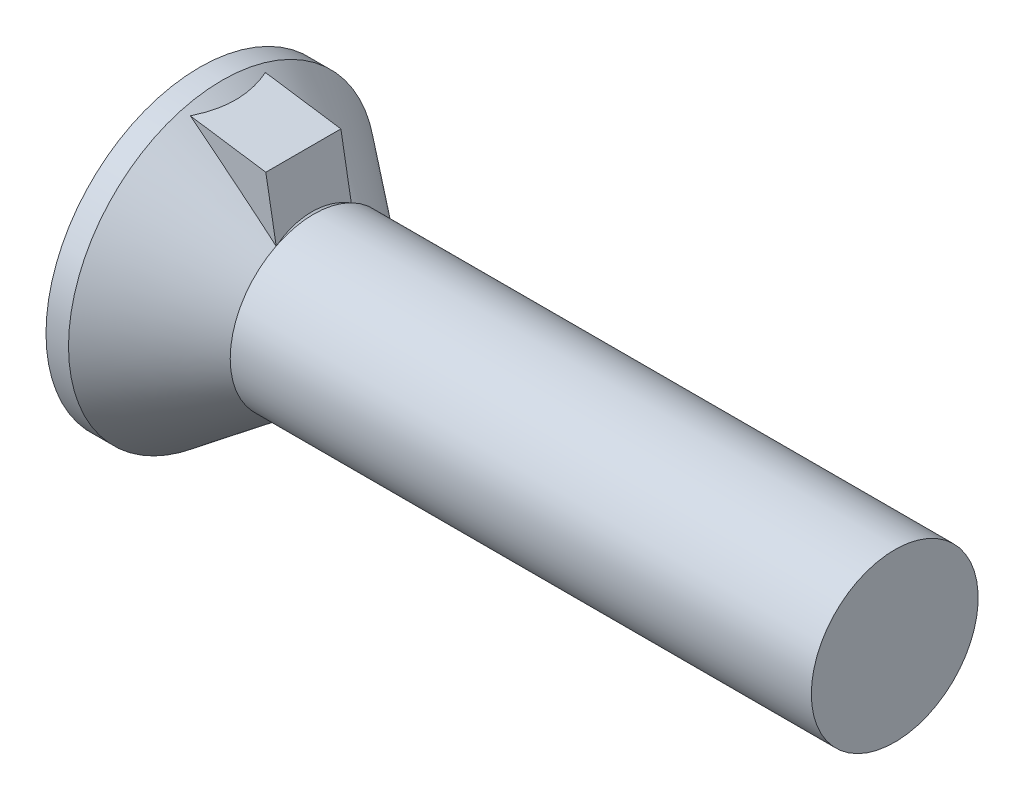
ISO-10303-21;
HEADER;
FILE_DESCRIPTION(('STEP AP214'),'2;1');
FILE_NAME('part.step','',(''),(''),'','','');
FILE_SCHEMA(('AUTOMOTIVE_DESIGN { 1 0 10303 214 1 1 1 1 }'));
ENDSEC;
DATA;
#1=APPLICATION_CONTEXT('core data for automotive mechanical design processes');
#2=APPLICATION_PROTOCOL_DEFINITION('international standard','automotive_design',2000,#1);
#3=PRODUCT_CONTEXT('',#1,'mechanical');
#4=PRODUCT('Part','Part','',(#3));
#5=PRODUCT_RELATED_PRODUCT_CATEGORY('part','',(#4));
#6=PRODUCT_DEFINITION_FORMATION('','',#4);
#7=PRODUCT_DEFINITION_CONTEXT('part definition',#1,'design');
#8=PRODUCT_DEFINITION('design','',#6,#7);
#9=PRODUCT_DEFINITION_SHAPE('','',#8);
#10=(LENGTH_UNIT() NAMED_UNIT(*) SI_UNIT(.MILLI.,.METRE.));
#11=(NAMED_UNIT(*) PLANE_ANGLE_UNIT() SI_UNIT($,.RADIAN.));
#12=(NAMED_UNIT(*) SI_UNIT($,.STERADIAN.) SOLID_ANGLE_UNIT());
#13=UNCERTAINTY_MEASURE_WITH_UNIT(LENGTH_MEASURE(1.E-05),#10,'distance_accuracy_value','');
#14=(GEOMETRIC_REPRESENTATION_CONTEXT(3) GLOBAL_UNCERTAINTY_ASSIGNED_CONTEXT((#13)) GLOBAL_UNIT_ASSIGNED_CONTEXT((#10,
#11,#12)) REPRESENTATION_CONTEXT('',''));
#15=CARTESIAN_POINT('',(0.,0.,0.));
#16=DIRECTION('',(0.,0.,1.));
#17=DIRECTION('',(1.,0.,0.));
#18=AXIS2_PLACEMENT_3D('',#15,#16,#17);
#19=CARTESIAN_POINT('',(4.1,0.,0.));
#20=DIRECTION('',(-1.,0.,0.));
#21=DIRECTION('',(0.,0.,1.));
#22=AXIS2_PLACEMENT_3D('',#19,#20,#21);
#23=CONICAL_SURFACE('',#22,3.,0.654498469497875);
#24=CARTESIAN_POINT('',(4.1,0.,0.));
#25=DIRECTION('',(-1.,0.,0.));
#26=DIRECTION('',(0.,0.,1.));
#27=AXIS2_PLACEMENT_3D('',#24,#25,#26);
#28=CIRCLE('',#27,3.);
#29=CARTESIAN_POINT('',(4.1,2.7,1.3076696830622));
#30=VERTEX_POINT('',#29);
#31=CARTESIAN_POINT('',(4.1,2.7,-1.3076696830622));
#32=VERTEX_POINT('',#31);
#33=EDGE_CURVE('E159',#30,#32,#28,.T.);
#34=ORIENTED_EDGE('',*,*,#33,.T.);
#35=CARTESIAN_POINT('',(4.51205464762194,0.363121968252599,0.));
#36=DIRECTION('',(0.984807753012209,0.173648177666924,0.));
#37=DIRECTION('',(-0.173648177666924,0.984807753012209,0.));
#38=AXIS2_PLACEMENT_3D('',#35,#36,#37);
#39=ELLIPSE('',#38,2.72522158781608,2.65914060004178);
#40=EDGE_CURVE('E161',#32,#30,#39,.T.);
#41=ORIENTED_EDGE('',*,*,#40,.T.);
#42=EDGE_LOOP('',(#34,#41));
#43=FACE_BOUND('',#42,.T.);
#44=ADVANCED_FACE('F37',(#43),#23,.T.);
#45=CARTESIAN_POINT('',(0.,0.,0.));
#46=DIRECTION('',(1.,0.,0.));
#47=DIRECTION('',(0.,0.,-1.));
#48=AXIS2_PLACEMENT_3D('',#45,#46,#47);
#49=PLANE('',#48);
#50=CARTESIAN_POINT('',(0.,0.,0.));
#51=DIRECTION('',(-1.,0.,0.));
#52=DIRECTION('',(0.,0.,1.));
#53=AXIS2_PLACEMENT_3D('',#50,#51,#52);
#54=CIRCLE('',#53,5.525);
#55=CARTESIAN_POINT('',(0.,0.,5.525));
#56=VERTEX_POINT('',#55);
#57=EDGE_CURVE('E172',#56,#56,#54,.T.);
#58=ORIENTED_EDGE('',*,*,#57,.T.);
#59=EDGE_LOOP('',(#58));
#60=FACE_BOUND('',#59,.T.);
#61=ADVANCED_FACE('F39',(#60),#49,.F.);
#62=CARTESIAN_POINT('',(-1.71435535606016,0.,0.));
#63=DIRECTION('',(-1.,0.,0.));
#64=DIRECTION('',(0.,0.,1.));
#65=AXIS2_PLACEMENT_3D('',#62,#63,#64);
#66=CYLINDRICAL_SURFACE('',#65,5.525);
#67=CARTESIAN_POINT('',(0.809355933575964,0.,0.));
#68=DIRECTION('',(-1.,0.,0.));
#69=DIRECTION('',(0.,0.,1.));
#70=AXIS2_PLACEMENT_3D('',#67,#68,#69);
#71=CIRCLE('',#70,5.525);
#72=CARTESIAN_POINT('',(0.809355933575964,0.,5.525));
#73=VERTEX_POINT('',#72);
#74=EDGE_CURVE('E162',#73,#73,#71,.T.);
#75=ORIENTED_EDGE('',*,*,#74,.T.);
#76=EDGE_LOOP('',(#75));
#77=FACE_BOUND('',#76,.T.);
#78=ORIENTED_EDGE('',*,*,#57,.F.);
#79=EDGE_LOOP('',(#78));
#80=FACE_BOUND('',#79,.T.);
#81=ADVANCED_FACE('F149',(#77,#80),#66,.T.);
#82=CARTESIAN_POINT('',(4.1,2.67908566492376,-1.35));
#83=VERTEX_POINT('',#82);
#84=CARTESIAN_POINT('',(4.1,2.67908566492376,1.35));
#85=VERTEX_POINT('',#84);
#86=EDGE_CURVE('E163',#83,#85,#28,.T.);
#87=ORIENTED_EDGE('',*,*,#86,.T.);
#88=CARTESIAN_POINT('',(-6.10405466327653,-10.745374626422,1.35));
#89=CARTESIAN_POINT('',(-5.6846367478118,-10.4210016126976,1.35));
#90=CARTESIAN_POINT('',(-5.2653178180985,-10.0965004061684,1.35));
#91=CARTESIAN_POINT('',(-4.42695643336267,-9.44709996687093,1.35));
#92=CARTESIAN_POINT('',(-4.00791399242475,-9.12220071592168,1.35));
#93=CARTESIAN_POINT('',(-3.1694143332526,-8.47126482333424,1.35));
#94=CARTESIAN_POINT('',(-2.74995787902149,-8.14522719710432,1.35));
#95=CARTESIAN_POINT('',(-1.91163137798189,-7.49243806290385,1.35));
#96=CARTESIAN_POINT('',(-1.49276130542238,-7.16568658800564,1.35));
#97=CARTESIAN_POINT('',(-0.608121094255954,-6.47378997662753,1.35));
#98=CARTESIAN_POINT('',(-0.142451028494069,-6.10851668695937,1.35));
#99=CARTESIAN_POINT('',(0.554778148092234,-5.55891745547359,1.35));
#100=CARTESIAN_POINT('',(0.786992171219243,-5.37542266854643,1.35));
#101=CARTESIAN_POINT('',(1.25082024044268,-5.00768101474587,1.35));
#102=CARTESIAN_POINT('',(1.48243429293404,-4.82343415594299,1.35));
#103=CARTESIAN_POINT('',(1.94449273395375,-4.4541762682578,1.35));
#104=CARTESIAN_POINT('',(2.17493834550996,-4.26916677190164,1.35));
#105=CARTESIAN_POINT('',(2.63463706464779,-3.89765073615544,1.35));
#106=CARTESIAN_POINT('',(2.8638901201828,-3.71114413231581,1.35));
#107=CARTESIAN_POINT('',(3.32051265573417,-3.33594787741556,1.35));
#108=CARTESIAN_POINT('',(3.54788260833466,-3.14725880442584,1.35));
#109=CARTESIAN_POINT('',(3.88662860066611,-2.86150208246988,1.35));
#110=CARTESIAN_POINT('',(3.99915513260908,-2.76579945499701,1.35));
#111=CARTESIAN_POINT('',(4.22316705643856,-2.5731847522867,1.35));
#112=CARTESIAN_POINT('',(4.33465247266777,-2.47627270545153,1.35));
#113=CARTESIAN_POINT('',(4.51233698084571,-2.31949711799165,1.35));
#114=CARTESIAN_POINT('',(4.57899410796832,-2.26015294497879,1.35));
#115=CARTESIAN_POINT('',(4.71165328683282,-2.14073052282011,1.35));
#116=CARTESIAN_POINT('',(4.7776553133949,-2.08065224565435,1.35));
#117=CARTESIAN_POINT('',(4.90893845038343,-1.95949160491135,1.35));
#118=CARTESIAN_POINT('',(4.97421816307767,-1.89840772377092,1.35));
#119=CARTESIAN_POINT('',(5.10369494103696,-1.77510877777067,1.35));
#120=CARTESIAN_POINT('',(5.16789208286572,-1.71289379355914,1.35));
#121=CARTESIAN_POINT('',(5.29431031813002,-1.58755833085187,1.35));
#122=CARTESIAN_POINT('',(5.3565436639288,-1.52445025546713,1.35));
#123=CARTESIAN_POINT('',(5.4790898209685,-1.39639890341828,1.35));
#124=CARTESIAN_POINT('',(5.53940287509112,-1.3314558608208,1.35));
#125=CARTESIAN_POINT('',(5.65718673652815,-1.19929624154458,1.35));
#126=CARTESIAN_POINT('',(5.71466378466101,-1.13208526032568,1.35));
#127=CARTESIAN_POINT('',(5.82563696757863,-0.994475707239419,1.35));
#128=CARTESIAN_POINT('',(5.87913628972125,-0.924079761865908,1.35));
#129=CARTESIAN_POINT('',(5.95740773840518,-0.811485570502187,1.35));
#130=CARTESIAN_POINT('',(5.98431528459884,-0.770777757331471,1.35));
#131=CARTESIAN_POINT('',(6.0357030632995,-0.68782224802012,1.35));
#132=CARTESIAN_POINT('',(6.06018241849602,-0.645574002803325,1.35));
#133=CARTESIAN_POINT('',(6.10583729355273,-0.559608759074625,1.35));
#134=CARTESIAN_POINT('',(6.12703062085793,-0.515901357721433,1.35));
#135=CARTESIAN_POINT('',(6.16532687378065,-0.426749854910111,1.35));
#136=CARTESIAN_POINT('',(6.18243295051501,-0.381307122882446,1.35));
#137=CARTESIAN_POINT('',(6.21555270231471,-0.275752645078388,1.35));
#138=CARTESIAN_POINT('',(6.22991763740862,-0.215098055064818,1.35));
#139=CARTESIAN_POINT('',(6.24801206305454,-0.0921817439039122,1.35));
#140=CARTESIAN_POINT('',(6.25174696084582,-0.0299208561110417,1.35));
#141=CARTESIAN_POINT('',(6.24789758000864,0.0942699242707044,1.35));
#142=CARTESIAN_POINT('',(6.24030635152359,0.156199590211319,1.35));
#143=CARTESIAN_POINT('',(6.2151340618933,0.277973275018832,1.35));
#144=CARTESIAN_POINT('',(6.19754132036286,0.337814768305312,1.35));
#145=CARTESIAN_POINT('',(6.15823100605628,0.44495195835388,1.35));
#146=CARTESIAN_POINT('',(6.13767121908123,0.492689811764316,1.35));
#147=CARTESIAN_POINT('',(6.09245087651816,0.586204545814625,1.35));
#148=CARTESIAN_POINT('',(6.06778691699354,0.631979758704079,1.35));
#149=CARTESIAN_POINT('',(6.01525960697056,0.721910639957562,1.35));
#150=CARTESIAN_POINT('',(5.98738217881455,0.766057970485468,1.35));
#151=CARTESIAN_POINT('',(5.92928894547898,0.852744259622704,1.35));
#152=CARTESIAN_POINT('',(5.89907415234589,0.89528390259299,1.35));
#153=CARTESIAN_POINT('',(5.83537754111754,0.980994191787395,1.35));
#154=CARTESIAN_POINT('',(5.8018088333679,1.02409985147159,1.35));
#155=CARTESIAN_POINT('',(5.73314680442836,1.10908343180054,1.35));
#156=CARTESIAN_POINT('',(5.69805322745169,1.15096114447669,1.35));
#157=CARTESIAN_POINT('',(5.59095300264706,1.27512038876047,1.35));
#158=CARTESIAN_POINT('',(5.51717230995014,1.35586881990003,1.35));
#159=CARTESIAN_POINT('',(5.36641672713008,1.5146678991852,1.35));
#160=CARTESIAN_POINT('',(5.28943429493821,1.59271127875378,1.35));
#161=CARTESIAN_POINT('',(5.13338306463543,1.74669481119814,1.35));
#162=CARTESIAN_POINT('',(5.05431401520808,1.82263470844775,1.35));
#163=CARTESIAN_POINT('',(4.89435691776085,1.97325845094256,1.35));
#164=CARTESIAN_POINT('',(4.81346254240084,2.04793554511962,1.35));
#165=CARTESIAN_POINT('',(4.65056459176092,2.19608181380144,1.35));
#166=CARTESIAN_POINT('',(4.56856091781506,2.26955087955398,1.35));
#167=CARTESIAN_POINT('',(4.40386173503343,2.41541285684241,1.35));
#168=CARTESIAN_POINT('',(4.3211677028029,2.48780743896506,1.35));
#169=CARTESIAN_POINT('',(4.15513110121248,2.63184201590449,1.35));
#170=CARTESIAN_POINT('',(4.07178855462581,2.70348203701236,1.35));
#171=CARTESIAN_POINT('',(3.82327322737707,2.91555200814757,1.35));
#172=CARTESIAN_POINT('',(3.65735841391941,3.05511198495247,1.35));
#173=CARTESIAN_POINT('',(3.32420307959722,3.33264217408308,1.35));
#174=CARTESIAN_POINT('',(3.15696252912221,3.47061235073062,1.35));
#175=CARTESIAN_POINT('',(2.82153505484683,3.74542189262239,1.35));
#176=CARTESIAN_POINT('',(2.65334806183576,3.88226117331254,1.35));
#177=CARTESIAN_POINT('',(2.31629005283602,4.15509519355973,1.35));
#178=CARTESIAN_POINT('',(2.14741903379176,4.29108992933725,1.35));
#179=CARTESIAN_POINT('',(1.63976846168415,4.69834525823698,1.35));
#180=CARTESIAN_POINT('',(1.3002254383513,4.968653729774,1.35));
#181=CARTESIAN_POINT('',(0.619928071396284,5.50770902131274,1.35));
#182=CARTESIAN_POINT('',(0.279173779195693,5.77645590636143,1.35));
#183=CARTESIAN_POINT('',(-0.401790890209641,6.31185148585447,1.35));
#184=CARTESIAN_POINT('',(-0.741998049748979,6.57850427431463,1.35));
#185=CARTESIAN_POINT('',(-1.42297427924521,7.11109844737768,1.35));
#186=CARTESIAN_POINT('',(-1.76374335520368,7.37703982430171,1.35));
#187=CARTESIAN_POINT('',(-2.78647969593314,8.17397155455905,1.35));
#188=CARTESIAN_POINT('',(-3.46904131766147,8.70419906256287,1.35));
#189=CARTESIAN_POINT('',(-4.31451706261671,9.35984621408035,1.35));
#190=CARTESIAN_POINT('',(-4.47701291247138,9.48580617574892,1.35));
#191=CARTESIAN_POINT('',(-4.80205765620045,9.73767050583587,1.35));
#192=CARTESIAN_POINT('',(-4.96460655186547,9.86357487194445,1.35));
#193=CARTESIAN_POINT('',(-5.28995375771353,10.1154918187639,1.35));
#194=CARTESIAN_POINT('',(-5.45275212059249,10.2415043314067,1.35));
#195=CARTESIAN_POINT('',(-5.77837970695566,10.4934765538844,1.35));
#196=CARTESIAN_POINT('',(-5.94120892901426,10.6194362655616,1.35));
#197=CARTESIAN_POINT('',(-6.10405466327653,10.745374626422,1.35));
#198=B_SPLINE_CURVE_WITH_KNOTS('',3,(#88,#89,#90,#91,#92,#93,#94,#95,#96,#97,#98,#99,#100,#101,
#102,#103,#104,#105,#106,#107,#108,#109,#110,#111,#112,#113,#114,#115,#116,#117,#118,#119,#120,
#121,#122,#123,#124,#125,#126,#127,#128,#129,#130,#131,#132,#133,#134,#135,#136,#137,#138,#139,
#140,#141,#142,#143,#144,#145,#146,#147,#148,#149,#150,#151,#152,#153,#154,#155,#156,#157,#158,
#159,#160,#161,#162,#163,#164,#165,#166,#167,#168,#169,#170,#171,#172,#173,#174,#175,#176,#177,
#178,#179,#180,#181,#182,#183,#184,#185,#186,#187,#188,#189,#190,#191,#192,#193,#194,#195,#196,
#197),.UNSPECIFIED.,.F.,.F.,(4,2,2,2,2,2,2,2,2,2,2,2,2,2,2,2,2,2,2,2,2,2,2,2,2,2,2,2,2,2,2,2,2,
2,2,2,2,2,2,2,2,2,2,2,2,2,2,2,2,2,2,2,2,2,4),(0.,1.59064881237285,3.18137321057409,
4.7751725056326,6.36889946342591,8.14441108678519,9.03229689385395,9.92017319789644,
10.8067368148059,11.6933388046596,12.579711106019,13.0228656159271,13.4660097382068,
13.7337445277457,14.001489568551,14.2696845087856,14.5378604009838,14.8037280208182,
15.0695618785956,15.3347819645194,15.5997871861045,15.7461137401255,15.892492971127,
16.0380489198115,16.1834922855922,16.3696836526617,16.555780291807,16.7419911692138,
16.9284199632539,17.0841213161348,17.2399524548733,17.3964942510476,17.5529686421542,
17.7168285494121,17.8807160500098,18.2087145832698,18.5375351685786,18.8663955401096,
19.1966606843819,19.5269553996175,19.8566671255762,20.1863673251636,20.8367672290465,
21.4871817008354,22.1376443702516,22.7881099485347,24.0901014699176,25.3920383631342,
26.6888027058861,27.9855809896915,30.5785076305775,31.1953036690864,31.8121232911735,
32.4297333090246,33.0473196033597),.UNSPECIFIED.);
#199=CARTESIAN_POINT('',(1.01474948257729,5.194847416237,1.35));
#200=VERTEX_POINT('',#199);
#201=EDGE_CURVE('E57',#85,#200,#198,.T.);
#202=ORIENTED_EDGE('',*,*,#201,.T.);
#203=CARTESIAN_POINT('',(1.01466902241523,5.1948592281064,1.3502));
#204=CARTESIAN_POINT('',(1.05143892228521,5.18946126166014,1.25884669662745));
#205=CARTESIAN_POINT('',(1.08530074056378,5.18449021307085,1.16622613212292));
#206=CARTESIAN_POINT('',(1.14629726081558,5.17553568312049,0.978593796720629));
#207=CARTESIAN_POINT('',(1.17342100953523,5.17155380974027,0.883578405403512));
#208=CARTESIAN_POINT('',(1.21981103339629,5.16474357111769,0.691986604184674));
#209=CARTESIAN_POINT('',(1.23910877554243,5.16191058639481,0.595418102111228));
#210=CARTESIAN_POINT('',(1.26918716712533,5.15749495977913,0.400982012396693));
#211=CARTESIAN_POINT('',(1.27997306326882,5.15591154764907,0.303115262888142));
#212=CARTESIAN_POINT('',(1.29259391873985,5.15405875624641,0.105924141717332));
#213=CARTESIAN_POINT('',(1.29434971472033,5.15380099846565,0.00659450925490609));
#214=CARTESIAN_POINT('',(1.28860699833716,5.15464405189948,-0.191814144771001));
#215=CARTESIAN_POINT('',(1.28110598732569,5.15574522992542,-0.290893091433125));
#216=CARTESIAN_POINT('',(1.25722666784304,5.15925080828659,-0.487847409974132));
#217=CARTESIAN_POINT('',(1.2408561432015,5.16165406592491,-0.585723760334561));
#218=CARTESIAN_POINT('',(1.19996942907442,5.16765639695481,-0.779724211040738));
#219=CARTESIAN_POINT('',(1.17545191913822,5.17125566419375,-0.875848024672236));
#220=CARTESIAN_POINT('',(1.12829350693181,5.17817870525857,-1.03521191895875));
#221=CARTESIAN_POINT('',(1.10760020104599,5.18121656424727,-1.099053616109));
#222=CARTESIAN_POINT('',(1.06326961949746,5.18772446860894,-1.22551462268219));
#223=CARTESIAN_POINT('',(1.03963950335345,5.1911934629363,-1.28813649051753));
#224=CARTESIAN_POINT('',(1.01466902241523,5.1948592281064,-1.3502));
#225=B_SPLINE_CURVE_WITH_KNOTS('',3,(#203,#204,#205,#206,#207,#208,#209,#210,#211,#212,#213,
#214,#215,#216,#217,#218,#219,#220,#221,#222,#223,#224),.UNSPECIFIED.,.F.,.F.,(4,2,2,2,2,2,2,2,
2,2,4),(0.,0.295918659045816,0.592315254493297,0.887507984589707,1.18251861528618,
1.48011113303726,1.77778399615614,2.07519604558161,2.37265632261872,2.57412532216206,
2.77511246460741),.UNSPECIFIED.);
#226=CARTESIAN_POINT('',(1.01474948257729,5.194847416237,-1.35));
#227=VERTEX_POINT('',#226);
#228=EDGE_CURVE('E11',#200,#227,#225,.T.);
#229=ORIENTED_EDGE('',*,*,#228,.T.);
#230=CARTESIAN_POINT('',(-6.10405466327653,-10.745374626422,-1.35));
#231=CARTESIAN_POINT('',(-5.6846367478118,-10.4210016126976,-1.35));
#232=CARTESIAN_POINT('',(-5.2653178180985,-10.0965004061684,-1.35));
#233=CARTESIAN_POINT('',(-4.42695643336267,-9.44709996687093,-1.35));
#234=CARTESIAN_POINT('',(-4.00791399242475,-9.12220071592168,-1.35));
#235=CARTESIAN_POINT('',(-3.1694143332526,-8.47126482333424,-1.35));
#236=CARTESIAN_POINT('',(-2.74995787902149,-8.14522719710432,-1.35));
#237=CARTESIAN_POINT('',(-1.91163137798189,-7.49243806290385,-1.35));
#238=CARTESIAN_POINT('',(-1.49276130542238,-7.16568658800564,-1.35));
#239=CARTESIAN_POINT('',(-0.608121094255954,-6.47378997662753,-1.35));
#240=CARTESIAN_POINT('',(-0.142451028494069,-6.10851668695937,-1.35));
#241=CARTESIAN_POINT('',(0.554778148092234,-5.55891745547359,-1.35));
#242=CARTESIAN_POINT('',(0.786992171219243,-5.37542266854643,-1.35));
#243=CARTESIAN_POINT('',(1.25082024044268,-5.00768101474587,-1.35));
#244=CARTESIAN_POINT('',(1.48243429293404,-4.82343415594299,-1.35));
#245=CARTESIAN_POINT('',(1.94449273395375,-4.4541762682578,-1.35));
#246=CARTESIAN_POINT('',(2.17493834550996,-4.26916677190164,-1.35));
#247=CARTESIAN_POINT('',(2.63463706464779,-3.89765073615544,-1.35));
#248=CARTESIAN_POINT('',(2.8638901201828,-3.71114413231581,-1.35));
#249=CARTESIAN_POINT('',(3.32051265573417,-3.33594787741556,-1.35));
#250=CARTESIAN_POINT('',(3.54788260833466,-3.14725880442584,-1.35));
#251=CARTESIAN_POINT('',(3.88662860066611,-2.86150208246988,-1.35));
#252=CARTESIAN_POINT('',(3.99915513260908,-2.76579945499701,-1.35));
#253=CARTESIAN_POINT('',(4.22316705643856,-2.5731847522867,-1.35));
#254=CARTESIAN_POINT('',(4.33465247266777,-2.47627270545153,-1.35));
#255=CARTESIAN_POINT('',(4.51233698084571,-2.31949711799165,-1.35));
#256=CARTESIAN_POINT('',(4.57899410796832,-2.26015294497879,-1.35));
#257=CARTESIAN_POINT('',(4.71165328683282,-2.14073052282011,-1.35));
#258=CARTESIAN_POINT('',(4.7776553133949,-2.08065224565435,-1.35));
#259=CARTESIAN_POINT('',(4.90893845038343,-1.95949160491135,-1.35));
#260=CARTESIAN_POINT('',(4.97421816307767,-1.89840772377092,-1.35));
#261=CARTESIAN_POINT('',(5.10369494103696,-1.77510877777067,-1.35));
#262=CARTESIAN_POINT('',(5.16789208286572,-1.71289379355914,-1.35));
#263=CARTESIAN_POINT('',(5.29431031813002,-1.58755833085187,-1.35));
#264=CARTESIAN_POINT('',(5.3565436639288,-1.52445025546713,-1.35));
#265=CARTESIAN_POINT('',(5.4790898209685,-1.39639890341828,-1.35));
#266=CARTESIAN_POINT('',(5.53940287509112,-1.3314558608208,-1.35));
#267=CARTESIAN_POINT('',(5.65718673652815,-1.19929624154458,-1.35));
#268=CARTESIAN_POINT('',(5.71466378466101,-1.13208526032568,-1.35));
#269=CARTESIAN_POINT('',(5.82563696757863,-0.994475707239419,-1.35));
#270=CARTESIAN_POINT('',(5.87913628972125,-0.924079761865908,-1.35));
#271=CARTESIAN_POINT('',(5.95740773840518,-0.811485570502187,-1.35));
#272=CARTESIAN_POINT('',(5.98431528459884,-0.770777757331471,-1.35));
#273=CARTESIAN_POINT('',(6.0357030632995,-0.68782224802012,-1.35));
#274=CARTESIAN_POINT('',(6.06018241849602,-0.645574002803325,-1.35));
#275=CARTESIAN_POINT('',(6.10583729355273,-0.559608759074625,-1.35));
#276=CARTESIAN_POINT('',(6.12703062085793,-0.515901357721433,-1.35));
#277=CARTESIAN_POINT('',(6.16532687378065,-0.426749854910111,-1.35));
#278=CARTESIAN_POINT('',(6.18243295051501,-0.381307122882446,-1.35));
#279=CARTESIAN_POINT('',(6.21555270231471,-0.275752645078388,-1.35));
#280=CARTESIAN_POINT('',(6.22991763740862,-0.215098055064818,-1.35));
#281=CARTESIAN_POINT('',(6.24801206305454,-0.0921817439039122,-1.35));
#282=CARTESIAN_POINT('',(6.25174696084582,-0.0299208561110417,-1.35));
#283=CARTESIAN_POINT('',(6.24789758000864,0.0942699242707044,-1.35));
#284=CARTESIAN_POINT('',(6.24030635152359,0.156199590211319,-1.35));
#285=CARTESIAN_POINT('',(6.2151340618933,0.277973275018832,-1.35));
#286=CARTESIAN_POINT('',(6.19754132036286,0.337814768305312,-1.35));
#287=CARTESIAN_POINT('',(6.15823100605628,0.44495195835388,-1.35));
#288=CARTESIAN_POINT('',(6.13767121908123,0.492689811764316,-1.35));
#289=CARTESIAN_POINT('',(6.09245087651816,0.586204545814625,-1.35));
#290=CARTESIAN_POINT('',(6.06778691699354,0.631979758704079,-1.35));
#291=CARTESIAN_POINT('',(6.01525960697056,0.721910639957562,-1.35));
#292=CARTESIAN_POINT('',(5.98738217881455,0.766057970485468,-1.35));
#293=CARTESIAN_POINT('',(5.92928894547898,0.852744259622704,-1.35));
#294=CARTESIAN_POINT('',(5.89907415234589,0.89528390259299,-1.35));
#295=CARTESIAN_POINT('',(5.83537754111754,0.980994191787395,-1.35));
#296=CARTESIAN_POINT('',(5.8018088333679,1.02409985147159,-1.35));
#297=CARTESIAN_POINT('',(5.73314680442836,1.10908343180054,-1.35));
#298=CARTESIAN_POINT('',(5.69805322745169,1.15096114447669,-1.35));
#299=CARTESIAN_POINT('',(5.59095300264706,1.27512038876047,-1.35));
#300=CARTESIAN_POINT('',(5.51717230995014,1.35586881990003,-1.35));
#301=CARTESIAN_POINT('',(5.36641672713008,1.5146678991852,-1.35));
#302=CARTESIAN_POINT('',(5.28943429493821,1.59271127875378,-1.35));
#303=CARTESIAN_POINT('',(5.13338306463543,1.74669481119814,-1.35));
#304=CARTESIAN_POINT('',(5.05431401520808,1.82263470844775,-1.35));
#305=CARTESIAN_POINT('',(4.89435691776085,1.97325845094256,-1.35));
#306=CARTESIAN_POINT('',(4.81346254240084,2.04793554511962,-1.35));
#307=CARTESIAN_POINT('',(4.65056459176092,2.19608181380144,-1.35));
#308=CARTESIAN_POINT('',(4.56856091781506,2.26955087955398,-1.35));
#309=CARTESIAN_POINT('',(4.40386173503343,2.41541285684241,-1.35));
#310=CARTESIAN_POINT('',(4.3211677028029,2.48780743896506,-1.35));
#311=CARTESIAN_POINT('',(4.15513110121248,2.63184201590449,-1.35));
#312=CARTESIAN_POINT('',(4.07178855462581,2.70348203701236,-1.35));
#313=CARTESIAN_POINT('',(3.82327322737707,2.91555200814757,-1.35));
#314=CARTESIAN_POINT('',(3.65735841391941,3.05511198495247,-1.35));
#315=CARTESIAN_POINT('',(3.32420307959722,3.33264217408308,-1.35));
#316=CARTESIAN_POINT('',(3.15696252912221,3.47061235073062,-1.35));
#317=CARTESIAN_POINT('',(2.82153505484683,3.74542189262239,-1.35));
#318=CARTESIAN_POINT('',(2.65334806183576,3.88226117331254,-1.35));
#319=CARTESIAN_POINT('',(2.31629005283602,4.15509519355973,-1.35));
#320=CARTESIAN_POINT('',(2.14741903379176,4.29108992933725,-1.35));
#321=CARTESIAN_POINT('',(1.63976846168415,4.69834525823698,-1.35));
#322=CARTESIAN_POINT('',(1.3002254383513,4.968653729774,-1.35));
#323=CARTESIAN_POINT('',(0.619928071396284,5.50770902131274,-1.35));
#324=CARTESIAN_POINT('',(0.279173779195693,5.77645590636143,-1.35));
#325=CARTESIAN_POINT('',(-0.401790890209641,6.31185148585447,-1.35));
#326=CARTESIAN_POINT('',(-0.741998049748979,6.57850427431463,-1.35));
#327=CARTESIAN_POINT('',(-1.42297427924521,7.11109844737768,-1.35));
#328=CARTESIAN_POINT('',(-1.76374335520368,7.37703982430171,-1.35));
#329=CARTESIAN_POINT('',(-2.78647969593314,8.17397155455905,-1.35));
#330=CARTESIAN_POINT('',(-3.46904131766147,8.70419906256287,-1.35));
#331=CARTESIAN_POINT('',(-4.31451706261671,9.35984621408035,-1.35));
#332=CARTESIAN_POINT('',(-4.47701291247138,9.48580617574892,-1.35));
#333=CARTESIAN_POINT('',(-4.80205765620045,9.73767050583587,-1.35));
#334=CARTESIAN_POINT('',(-4.96460655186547,9.86357487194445,-1.35));
#335=CARTESIAN_POINT('',(-5.28995375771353,10.1154918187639,-1.35));
#336=CARTESIAN_POINT('',(-5.45275212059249,10.2415043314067,-1.35));
#337=CARTESIAN_POINT('',(-5.77837970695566,10.4934765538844,-1.35));
#338=CARTESIAN_POINT('',(-5.94120892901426,10.6194362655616,-1.35));
#339=CARTESIAN_POINT('',(-6.10405466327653,10.745374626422,-1.35));
#340=B_SPLINE_CURVE_WITH_KNOTS('',3,(#230,#231,#232,#233,#234,#235,#236,#237,#238,#239,#240,
#241,#242,#243,#244,#245,#246,#247,#248,#249,#250,#251,#252,#253,#254,#255,#256,#257,#258,#259,
#260,#261,#262,#263,#264,#265,#266,#267,#268,#269,#270,#271,#272,#273,#274,#275,#276,#277,#278,
#279,#280,#281,#282,#283,#284,#285,#286,#287,#288,#289,#290,#291,#292,#293,#294,#295,#296,#297,
#298,#299,#300,#301,#302,#303,#304,#305,#306,#307,#308,#309,#310,#311,#312,#313,#314,#315,#316,
#317,#318,#319,#320,#321,#322,#323,#324,#325,#326,#327,#328,#329,#330,#331,#332,#333,#334,#335,
#336,#337,#338,#339),.UNSPECIFIED.,.F.,.F.,(4,2,2,2,2,2,2,2,2,2,2,2,2,2,2,2,2,2,2,2,2,2,2,2,2,2,
2,2,2,2,2,2,2,2,2,2,2,2,2,2,2,2,2,2,2,2,2,2,2,2,2,2,2,2,4),(0.,1.59064881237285,
3.18137321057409,4.7751725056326,6.36889946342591,8.14441108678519,9.03229689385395,
9.92017319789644,10.8067368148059,11.6933388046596,12.579711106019,13.0228656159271,
13.4660097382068,13.7337445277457,14.001489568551,14.2696845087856,14.5378604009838,
14.8037280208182,15.0695618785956,15.3347819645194,15.5997871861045,15.7461137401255,
15.892492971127,16.0380489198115,16.1834922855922,16.3696836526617,16.555780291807,
16.7419911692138,16.9284199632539,17.0841213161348,17.2399524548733,17.3964942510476,
17.5529686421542,17.7168285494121,17.8807160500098,18.2087145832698,18.5375351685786,
18.8663955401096,19.1966606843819,19.5269553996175,19.8566671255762,20.1863673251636,
20.8367672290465,21.4871817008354,22.1376443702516,22.7881099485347,24.0901014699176,
25.3920383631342,26.6888027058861,27.9855809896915,30.5785076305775,31.1953036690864,
31.8121232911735,32.4297333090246,33.0473196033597),.UNSPECIFIED.);
#341=EDGE_CURVE('E107',#83,#227,#340,.T.);
#342=ORIENTED_EDGE('',*,*,#341,.F.);
#343=EDGE_LOOP('',(#87,#202,#229,#342));
#344=FACE_BOUND('',#343,.T.);
#345=ORIENTED_EDGE('',*,*,#74,.F.);
#346=EDGE_LOOP('',(#345));
#347=FACE_BOUND('',#346,.T.);
#348=ADVANCED_FACE('F127',(#344,#347),#23,.T.);
#349=CARTESIAN_POINT('',(-1.71435535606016,0.,0.));
#350=DIRECTION('',(-1.,0.,0.));
#351=DIRECTION('',(0.,0.,1.));
#352=AXIS2_PLACEMENT_3D('',#349,#350,#351);
#353=CYLINDRICAL_SURFACE('',#352,3.);
#354=ORIENTED_EDGE('',*,*,#33,.F.);
#355=CARTESIAN_POINT('',(4.57608284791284,0.,0.));
#356=DIRECTION('',(0.984807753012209,0.173648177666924,0.));
#357=DIRECTION('',(-0.173648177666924,0.984807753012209,0.));
#358=AXIS2_PLACEMENT_3D('',#355,#356,#357);
#359=ELLIPSE('',#358,3.04627983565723,3.);
#360=CARTESIAN_POINT('',(4.10368776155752,2.67908566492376,1.35));
#361=VERTEX_POINT('',#360);
#362=EDGE_CURVE('E51',#30,#361,#359,.T.);
#363=ORIENTED_EDGE('',*,*,#362,.T.);
#364=DIRECTION('',(-1.,0.,0.));
#365=VECTOR('',#364,1.);
#366=CARTESIAN_POINT('',(-1.71435535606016,2.67908566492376,1.35));
#367=LINE('',#366,#365);
#368=EDGE_CURVE('E94',#361,#85,#367,.T.);
#369=ORIENTED_EDGE('',*,*,#368,.T.);
#370=ORIENTED_EDGE('',*,*,#86,.F.);
#371=DIRECTION('',(-1.,0.,0.));
#372=VECTOR('',#371,1.);
#373=CARTESIAN_POINT('',(-1.71435535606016,2.67908566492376,-1.35));
#374=LINE('',#373,#372);
#375=CARTESIAN_POINT('',(4.10368776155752,2.67908566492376,-1.35));
#376=VERTEX_POINT('',#375);
#377=EDGE_CURVE('E175',#376,#83,#374,.T.);
#378=ORIENTED_EDGE('',*,*,#377,.F.);
#379=EDGE_CURVE('E165',#376,#32,#359,.T.);
#380=ORIENTED_EDGE('',*,*,#379,.T.);
#381=EDGE_LOOP('',(#354,#363,#369,#370,#378,#380));
#382=FACE_BOUND('',#381,.T.);
#383=CARTESIAN_POINT('',(25.,0.,0.));
#384=DIRECTION('',(-1.,0.,0.));
#385=DIRECTION('',(0.,0.,1.));
#386=AXIS2_PLACEMENT_3D('',#383,#384,#385);
#387=CIRCLE('',#386,3.);
#388=CARTESIAN_POINT('',(25.,0.,3.));
#389=VERTEX_POINT('',#388);
#390=EDGE_CURVE('E166',#389,#389,#387,.T.);
#391=ORIENTED_EDGE('',*,*,#390,.T.);
#392=EDGE_LOOP('',(#391));
#393=FACE_BOUND('',#392,.T.);
#394=ADVANCED_FACE('F142',(#382,#393),#353,.T.);
#395=CARTESIAN_POINT('',(25.,3.,0.));
#396=DIRECTION('',(-1.,0.,0.));
#397=DIRECTION('',(0.,0.,1.));
#398=AXIS2_PLACEMENT_3D('',#395,#396,#397);
#399=PLANE('',#398);
#400=ORIENTED_EDGE('',*,*,#390,.F.);
#401=EDGE_LOOP('',(#400));
#402=FACE_BOUND('',#401,.T.);
#403=ADVANCED_FACE('F138',(#402),#399,.F.);
#404=CARTESIAN_POINT('',(3.73038670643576,4.79618115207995,0.));
#405=DIRECTION('',(0.145247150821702,0.989395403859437,0.));
#406=DIRECTION('',(-0.989395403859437,0.145247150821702,0.));
#407=AXIS2_PLACEMENT_3D('',#404,#405,#406);
#408=PLANE('',#407);
#409=ORIENTED_EDGE('',*,*,#228,.F.);
#410=DIRECTION('',(-0.989395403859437,0.145247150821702,0.));
#411=VECTOR('',#410,1.);
#412=CARTESIAN_POINT('',(3.73038670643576,4.79618115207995,1.35));
#413=LINE('',#412,#411);
#414=CARTESIAN_POINT('',(3.73038670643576,4.79618115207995,1.35));
#415=VERTEX_POINT('',#414);
#416=EDGE_CURVE('E92',#415,#200,#413,.T.);
#417=ORIENTED_EDGE('',*,*,#416,.F.);
#418=DIRECTION('',(0.,0.,1.));
#419=VECTOR('',#418,1.);
#420=CARTESIAN_POINT('',(3.73038670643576,4.79618115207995,0.));
#421=LINE('',#420,#419);
#422=CARTESIAN_POINT('',(3.73038670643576,4.79618115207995,-1.35));
#423=VERTEX_POINT('',#422);
#424=EDGE_CURVE('E97',#423,#415,#421,.T.);
#425=ORIENTED_EDGE('',*,*,#424,.F.);
#426=DIRECTION('',(-0.989395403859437,0.145247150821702,0.));
#427=VECTOR('',#426,1.);
#428=CARTESIAN_POINT('',(3.73038670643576,4.79618115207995,-1.35));
#429=LINE('',#428,#427);
#430=EDGE_CURVE('E111',#423,#227,#429,.T.);
#431=ORIENTED_EDGE('',*,*,#430,.T.);
#432=EDGE_LOOP('',(#409,#417,#425,#431));
#433=FACE_BOUND('',#432,.T.);
#434=ADVANCED_FACE('F109',(#433),#408,.T.);
#435=CARTESIAN_POINT('',(4.1,2.7,0.));
#436=DIRECTION('',(0.984807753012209,0.173648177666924,0.));
#437=DIRECTION('',(-0.173648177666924,0.984807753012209,0.));
#438=AXIS2_PLACEMENT_3D('',#435,#436,#437);
#439=PLANE('',#438);
#440=ORIENTED_EDGE('',*,*,#379,.F.);
#441=DIRECTION('',(-0.173648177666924,0.984807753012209,0.));
#442=VECTOR('',#441,1.);
#443=CARTESIAN_POINT('',(4.1,2.7,-1.35));
#444=LINE('',#443,#442);
#445=EDGE_CURVE('E103',#376,#423,#444,.T.);
#446=ORIENTED_EDGE('',*,*,#445,.T.);
#447=ORIENTED_EDGE('',*,*,#424,.T.);
#448=DIRECTION('',(-0.173648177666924,0.984807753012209,0.));
#449=VECTOR('',#448,1.);
#450=CARTESIAN_POINT('',(4.1,2.7,1.35));
#451=LINE('',#450,#449);
#452=EDGE_CURVE('E88',#361,#415,#451,.T.);
#453=ORIENTED_EDGE('',*,*,#452,.F.);
#454=ORIENTED_EDGE('',*,*,#362,.F.);
#455=ORIENTED_EDGE('',*,*,#40,.F.);
#456=EDGE_LOOP('',(#440,#446,#447,#453,#454,#455));
#457=FACE_BOUND('',#456,.T.);
#458=ADVANCED_FACE('F101',(#457),#439,.T.);
#459=CARTESIAN_POINT('',(12.5,0.,1.35));
#460=DIRECTION('',(0.,0.,1.));
#461=DIRECTION('',(1.,0.,0.));
#462=AXIS2_PLACEMENT_3D('',#459,#460,#461);
#463=PLANE('',#462);
#464=ORIENTED_EDGE('',*,*,#201,.F.);
#465=ORIENTED_EDGE('',*,*,#368,.F.);
#466=ORIENTED_EDGE('',*,*,#452,.T.);
#467=ORIENTED_EDGE('',*,*,#416,.T.);
#468=EDGE_LOOP('',(#464,#465,#466,#467));
#469=FACE_BOUND('',#468,.T.);
#470=ADVANCED_FACE('F90',(#469),#463,.T.);
#471=CARTESIAN_POINT('',(12.5,0.,-1.35));
#472=DIRECTION('',(0.,0.,1.));
#473=DIRECTION('',(1.,0.,0.));
#474=AXIS2_PLACEMENT_3D('',#471,#472,#473);
#475=PLANE('',#474);
#476=ORIENTED_EDGE('',*,*,#377,.T.);
#477=ORIENTED_EDGE('',*,*,#341,.T.);
#478=ORIENTED_EDGE('',*,*,#430,.F.);
#479=ORIENTED_EDGE('',*,*,#445,.F.);
#480=EDGE_LOOP('',(#476,#477,#478,#479));
#481=FACE_BOUND('',#480,.T.);
#482=ADVANCED_FACE('F130',(#481),#475,.F.);
#483=CLOSED_SHELL('',(#44,#61,#81,#348,#394,#403,#434,#458,#470,#482));
#484=MANIFOLD_SOLID_BREP('B2',#483);
#485=ADVANCED_BREP_SHAPE_REPRESENTATION('',(#18,#484),#14);
#486=SHAPE_DEFINITION_REPRESENTATION(#9,#485);
ENDSEC;
END-ISO-10303-21;
